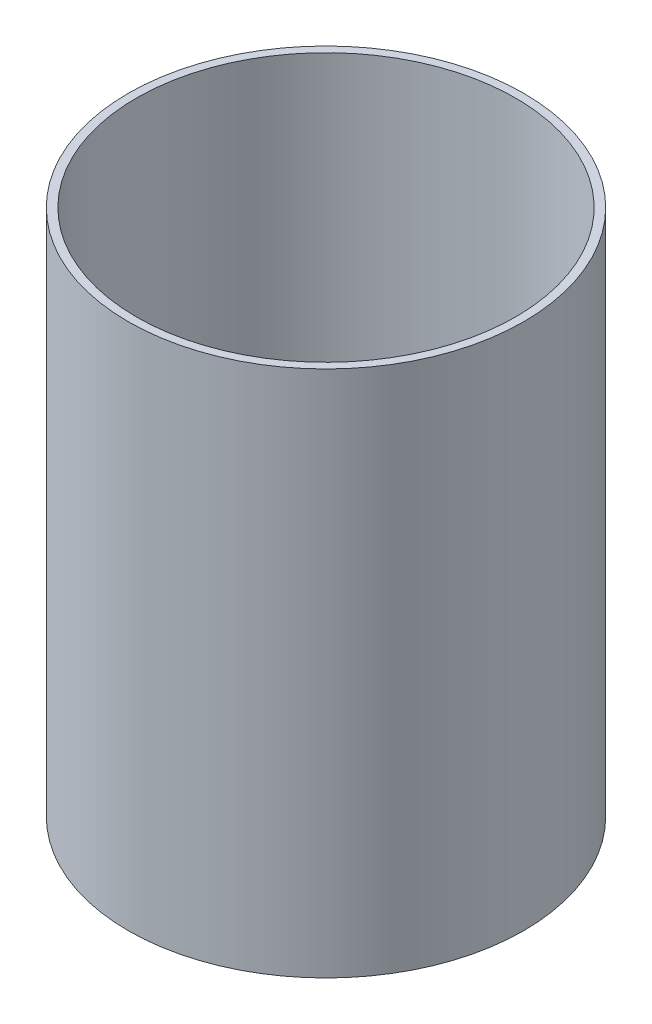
ISO-10303-21;
HEADER;
FILE_DESCRIPTION(('STEP AP214'),'2;1');
FILE_NAME('part.step','',(''),(''),'','','');
FILE_SCHEMA(('AUTOMOTIVE_DESIGN { 1 0 10303 214 1 1 1 1 }'));
ENDSEC;
DATA;
#1=APPLICATION_CONTEXT('core data for automotive mechanical design processes');
#2=APPLICATION_PROTOCOL_DEFINITION('international standard','automotive_design',2000,#1);
#3=PRODUCT_CONTEXT('',#1,'mechanical');
#4=PRODUCT('Part','Part','',(#3));
#5=PRODUCT_RELATED_PRODUCT_CATEGORY('part','',(#4));
#6=PRODUCT_DEFINITION_FORMATION('','',#4);
#7=PRODUCT_DEFINITION_CONTEXT('part definition',#1,'design');
#8=PRODUCT_DEFINITION('design','',#6,#7);
#9=PRODUCT_DEFINITION_SHAPE('','',#8);
#10=(LENGTH_UNIT() NAMED_UNIT(*) SI_UNIT(.MILLI.,.METRE.));
#11=(NAMED_UNIT(*) PLANE_ANGLE_UNIT() SI_UNIT($,.RADIAN.));
#12=(NAMED_UNIT(*) SI_UNIT($,.STERADIAN.) SOLID_ANGLE_UNIT());
#13=UNCERTAINTY_MEASURE_WITH_UNIT(LENGTH_MEASURE(1.E-05),#10,'distance_accuracy_value','');
#14=(GEOMETRIC_REPRESENTATION_CONTEXT(3) GLOBAL_UNCERTAINTY_ASSIGNED_CONTEXT((#13)) GLOBAL_UNIT_ASSIGNED_CONTEXT((#10,
#11,#12)) REPRESENTATION_CONTEXT('',''));
#15=CARTESIAN_POINT('',(0.,0.,0.));
#16=DIRECTION('',(0.,0.,1.));
#17=DIRECTION('',(1.,0.,0.));
#18=AXIS2_PLACEMENT_3D('',#15,#16,#17);
#19=CARTESIAN_POINT('',(0.,50.8,0.));
#20=DIRECTION('',(0.,1.,0.));
#21=DIRECTION('',(0.,0.,1.));
#22=AXIS2_PLACEMENT_3D('',#19,#20,#21);
#23=PLANE('',#22);
#24=CARTESIAN_POINT('',(0.,50.8,0.));
#25=DIRECTION('',(0.,1.,0.));
#26=DIRECTION('',(0.,0.,1.));
#27=AXIS2_PLACEMENT_3D('',#24,#25,#26);
#28=CIRCLE('',#27,19.05);
#29=CARTESIAN_POINT('',(0.,50.8,19.05));
#30=VERTEX_POINT('',#29);
#31=EDGE_CURVE('E10',#30,#30,#28,.T.);
#32=ORIENTED_EDGE('',*,*,#31,.T.);
#33=EDGE_LOOP('',(#32));
#34=FACE_BOUND('',#33,.T.);
#35=CARTESIAN_POINT('',(0.,50.8,0.));
#36=DIRECTION('',(0.,1.,0.));
#37=DIRECTION('',(0.,0.,1.));
#38=AXIS2_PLACEMENT_3D('',#35,#36,#37);
#39=CIRCLE('',#38,18.2626);
#40=CARTESIAN_POINT('',(0.,50.8,18.2626));
#41=VERTEX_POINT('',#40);
#42=EDGE_CURVE('E42',#41,#41,#39,.T.);
#43=ORIENTED_EDGE('',*,*,#42,.F.);
#44=EDGE_LOOP('',(#43));
#45=FACE_BOUND('',#44,.T.);
#46=ADVANCED_FACE('F31',(#34,#45),#23,.T.);
#47=CARTESIAN_POINT('',(0.,0.,0.));
#48=DIRECTION('',(0.,1.,0.));
#49=DIRECTION('',(0.,0.,1.));
#50=AXIS2_PLACEMENT_3D('',#47,#48,#49);
#51=PLANE('',#50);
#52=CARTESIAN_POINT('',(0.,0.,0.));
#53=DIRECTION('',(0.,1.,0.));
#54=DIRECTION('',(0.,0.,1.));
#55=AXIS2_PLACEMENT_3D('',#52,#53,#54);
#56=CIRCLE('',#55,19.05);
#57=CARTESIAN_POINT('',(0.,0.,19.05));
#58=VERTEX_POINT('',#57);
#59=EDGE_CURVE('E35',#58,#58,#56,.T.);
#60=ORIENTED_EDGE('',*,*,#59,.F.);
#61=EDGE_LOOP('',(#60));
#62=FACE_BOUND('',#61,.T.);
#63=CARTESIAN_POINT('',(0.,0.,0.));
#64=DIRECTION('',(0.,1.,0.));
#65=DIRECTION('',(0.,0.,1.));
#66=AXIS2_PLACEMENT_3D('',#63,#64,#65);
#67=CIRCLE('',#66,18.2626);
#68=CARTESIAN_POINT('',(0.,0.,18.2626));
#69=VERTEX_POINT('',#68);
#70=EDGE_CURVE('E44',#69,#69,#67,.T.);
#71=ORIENTED_EDGE('',*,*,#70,.T.);
#72=EDGE_LOOP('',(#71));
#73=FACE_BOUND('',#72,.T.);
#74=ADVANCED_FACE('F54',(#62,#73),#51,.F.);
#75=CARTESIAN_POINT('',(0.,50.8,0.));
#76=DIRECTION('',(0.,-1.,0.));
#77=DIRECTION('',(0.,0.,-1.));
#78=AXIS2_PLACEMENT_3D('',#75,#76,#77);
#79=CYLINDRICAL_SURFACE('',#78,19.05);
#80=ORIENTED_EDGE('',*,*,#31,.F.);
#81=EDGE_LOOP('',(#80));
#82=FACE_BOUND('',#81,.T.);
#83=ORIENTED_EDGE('',*,*,#59,.T.);
#84=EDGE_LOOP('',(#83));
#85=FACE_BOUND('',#84,.T.);
#86=ADVANCED_FACE('F33',(#82,#85),#79,.T.);
#87=CARTESIAN_POINT('',(0.,50.8,0.));
#88=DIRECTION('',(0.,-1.,0.));
#89=DIRECTION('',(0.,0.,-1.));
#90=AXIS2_PLACEMENT_3D('',#87,#88,#89);
#91=CYLINDRICAL_SURFACE('',#90,18.2626);
#92=ORIENTED_EDGE('',*,*,#42,.T.);
#93=EDGE_LOOP('',(#92));
#94=FACE_BOUND('',#93,.T.);
#95=ORIENTED_EDGE('',*,*,#70,.F.);
#96=EDGE_LOOP('',(#95));
#97=FACE_BOUND('',#96,.T.);
#98=ADVANCED_FACE('F50',(#94,#97),#91,.F.);
#99=CLOSED_SHELL('',(#46,#74,#86,#98));
#100=MANIFOLD_SOLID_BREP('B2',#99);
#101=ADVANCED_BREP_SHAPE_REPRESENTATION('',(#18,#100),#14);
#102=SHAPE_DEFINITION_REPRESENTATION(#9,#101);
ENDSEC;
END-ISO-10303-21;
